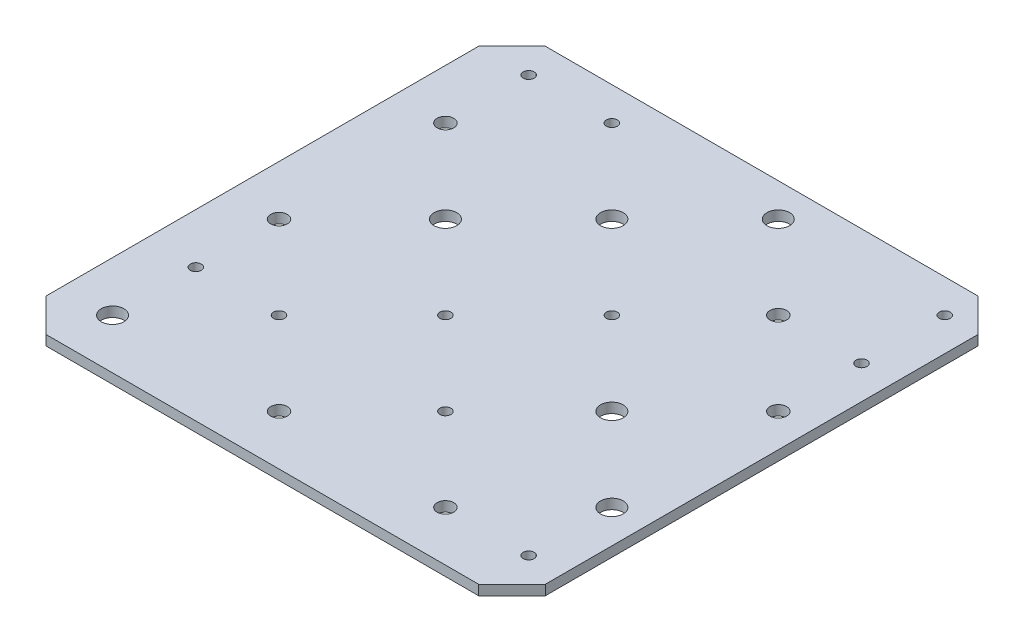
from build123d import *

# Parameters (mm, degrees)
SKETCH2_W                    = 150
SKETCH2_H                    = 150
BOSS_EXTRUDE2_DEPTH          = 3
TAP_DRILL_FOR_M4X0_7_TAP1_D  = 3.3
TAP_DRILL_FOR_M6X1_0_TAP1_D  = 5
TAP_DRILL_FOR_M8X1_25_TAP1_D = 6.8
TAP_DRILL_FOR_M4X0_7_TAP2_D  = 3.3
CHAMFER1_SIZE                = 10


with BuildPart() as part:
    # Sketch2 → Boss-Extrude2 (new body)
    with BuildSketch(Plane(origin=(0, 0, 0), x_dir=(1, 0, 0), z_dir=(0, 1, 0))):
        Rectangle(SKETCH2_W, SKETCH2_H)
    extrude(amount=BOSS_EXTRUDE2_DEPTH)

    # Tap Drill for M4x0.7 Tap1 (through all)
    with Locations(Plane(origin=(0, 3, 0), x_dir=(1, 0, 0), z_dir=(0, 1, 0))):
        with Locations((-35, 65), (65, 65), (15, 15), (-35, -35), (-10, -10), (15, -35)):
            Hole(TAP_DRILL_FOR_M4X0_7_TAP1_D / 2)

    # Tap Drill for M6x1.0 Tap1 (through all)
    with Locations(Plane(origin=(0, 3, 0), x_dir=(1, 0, 0), z_dir=(0, 1, 0))):
        with Locations((40, 40), (-60, 40), (65, 15), (40, -60), (-10, -60), (-60, -10), (176.187767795, 220.177696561)):
            Hole(TAP_DRILL_FOR_M6X1_0_TAP1_D / 2)

    # Tap Drill for M8x1.25 Tap1 (through all)
    with Locations(Plane(origin=(0, 3, 0), x_dir=(1, 0, 0), z_dir=(0, 1, 0))):
        with Locations((65, -35), (40, -10), (-10, 40), (15, 65), (-60, -60), (-35, 15)):
            Hole(TAP_DRILL_FOR_M8X1_25_TAP1_D / 2)

    # Tap Drill for M4x0.7 Tap2 (through all)
    with Locations(Plane(origin=(0, 3, 0), x_dir=(1, 0, 0), z_dir=(0, 1, 0))):
        with Locations((-60, 65), (65, 40), (-60, -35), (65, -60)):
            Hole(TAP_DRILL_FOR_M4X0_7_TAP2_D / 2)

    # Chamfer1
    chamfer1_edges = [part.edges().sort_by_distance(p)[0] for p in [
        (75, 1.5, 75),
        (-75, 1.5, 75),
        (-75, 1.5, -75),
        (75, 1.5, -75),
    ]]
    chamfer(chamfer1_edges, length=CHAMFER1_SIZE)


solid = part.part
